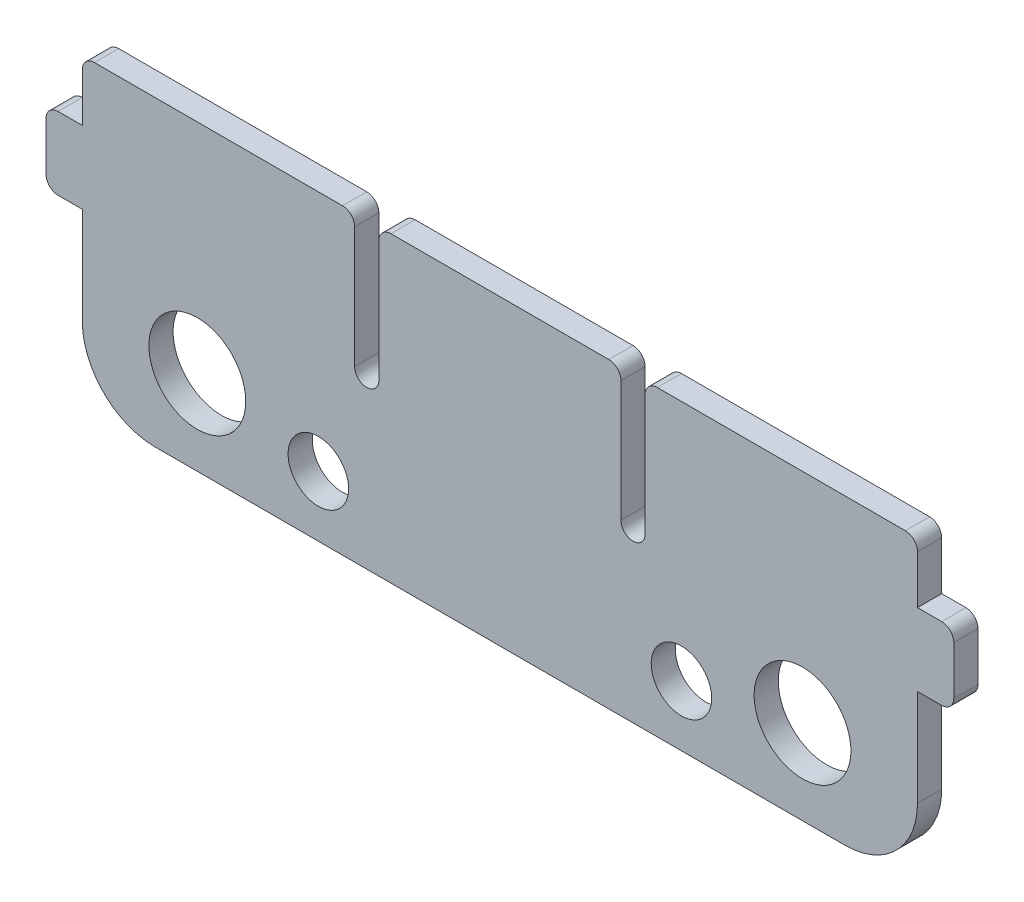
from build123d import *

# Parameters (mm, degrees)
ESBO_O1_R                = 4
ESBO_O1_R_2              = 2.5
RESSALTO_EXTRUS_O1_DEPTH = 2


with BuildPart() as part:
    # Esbo_o1 → Ressalto-extrus_o1 (new body)
    with BuildSketch(Plane.XY):
        with BuildLine():
            Line((-34.5, 1.5), (-34.5, -6.5))
            ThreePointArc((-34.5, -6.5), (-32.742640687, -10.742640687), (-28.5, -12.5))
            Line((-28.5, -12.5), (28.5, -12.5))
            ThreePointArc((28.5, -12.5), (32.742640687, -10.742640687), (34.5, -6.5))
            Line((34.5, -6.5), (34.5, 1.5))
            Line((34.5, 1.5), (36.5, 1.5))
            ThreePointArc((36.5, 1.5), (37.207106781, 1.792893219), (37.5, 2.5))
            Line((37.5, 2.5), (37.5, 6.5))
            ThreePointArc((37.5, 6.5), (37.207106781, 7.207106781), (36.5, 7.5))
            Line((36.5, 7.5), (34.5, 7.5))
            Line((34.5, 7.5), (34.5, 11.5))
            ThreePointArc((34.5, 11.5), (34.207106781, 12.207106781), (33.5, 12.5))
            Line((33.5, 12.5), (13, 12.5))
            ThreePointArc((13, 12.5), (12.292893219, 12.207106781), (12, 11.5))
            Line((12, 11.5), (12, 1.5))
            ThreePointArc((12, 1.5), (11, 0.5), (10, 1.5))
            Line((10, 1.5), (10, 11.5))
            ThreePointArc((10, 11.5), (9.707106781, 12.207106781), (9, 12.5))
            Line((9, 12.5), (-9, 12.5))
            ThreePointArc((-9, 12.5), (-9.707106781, 12.207106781), (-10, 11.5))
            Line((-10, 11.5), (-10, 1.5))
            ThreePointArc((-10, 1.5), (-11, 0.5), (-12, 1.5))
            Line((-12, 1.5), (-12, 11.5))
            ThreePointArc((-12, 11.5), (-12.292893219, 12.207106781), (-13, 12.5))
            Line((-13, 12.5), (-33.5, 12.5))
            ThreePointArc((-33.5, 12.5), (-34.207106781, 12.207106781), (-34.5, 11.5))
            Line((-34.5, 11.5), (-34.5, 7.5))
            Line((-34.5, 7.5), (-36.5, 7.5))
            ThreePointArc((-36.5, 7.5), (-37.207106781, 7.207106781), (-37.5, 6.5))
            Line((-37.5, 6.5), (-37.5, 2.5))
            ThreePointArc((-37.5, 2.5), (-37.207106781, 1.792893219), (-36.5, 1.5))
            Line((-36.5, 1.5), (-34.5, 1.5))
        make_face()
        with Locations((-25, -5.5)):
            Circle(ESBO_O1_R, mode=Mode.SUBTRACT)
        with Locations((-15, -7.5)):
            Circle(ESBO_O1_R_2, mode=Mode.SUBTRACT)
        with Locations(Location((15, -7.5, 0), (0, 0, 180))):
            Circle(ESBO_O1_R_2, mode=Mode.SUBTRACT)
        with Locations(Location((25, -5.5, 0), (0, 0, 180))):
            Circle(ESBO_O1_R, mode=Mode.SUBTRACT)
    extrude(amount=RESSALTO_EXTRUS_O1_DEPTH)


solid = part.part
